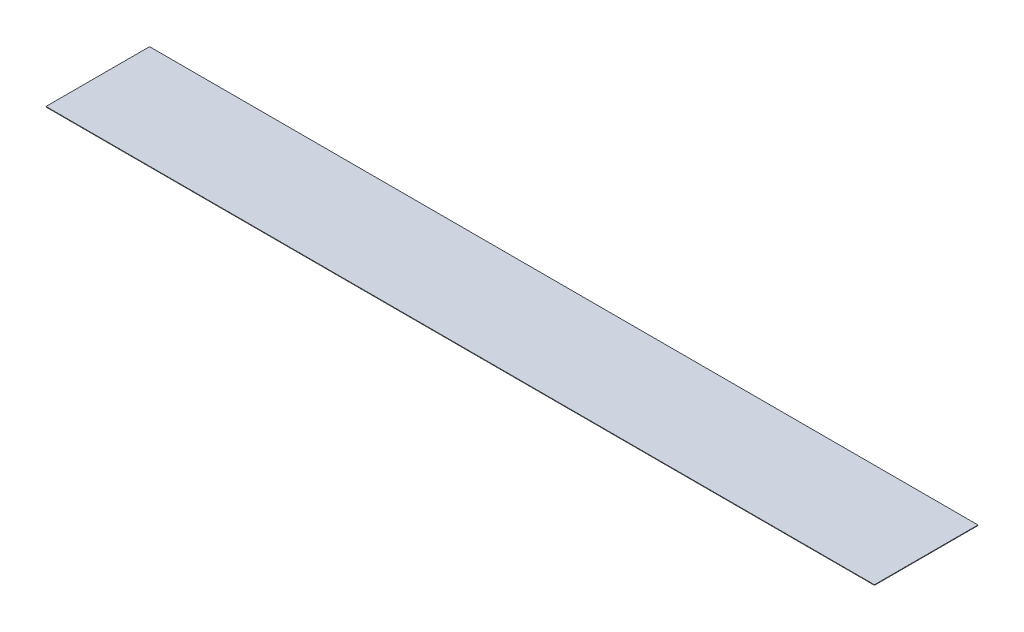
from build123d import *

# Parameters (mm, degrees)
SKETCH1_W           = 406.4
SKETCH1_H           = 50.8
BOSS_EXTRUDE1_DEPTH = 0.254


with BuildPart() as part:
    # Sketch1 → Boss-Extrude1 (new body)
    with BuildSketch(Plane(origin=(0, 0, 0), x_dir=(1, 0, 0), z_dir=(0, 1, 0))):
        Rectangle(SKETCH1_W, SKETCH1_H)
    extrude(amount=BOSS_EXTRUDE1_DEPTH)


solid = part.part
